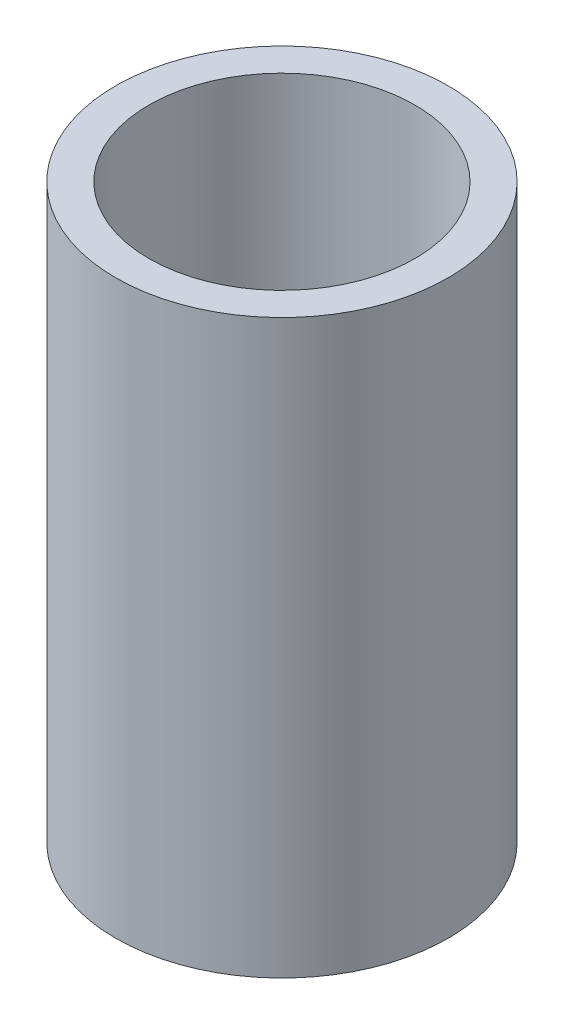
ISO-10303-21;
HEADER;
FILE_DESCRIPTION(('STEP AP214'),'2;1');
FILE_NAME('part.step','',(''),(''),'','','');
FILE_SCHEMA(('AUTOMOTIVE_DESIGN { 1 0 10303 214 1 1 1 1 }'));
ENDSEC;
DATA;
#1=APPLICATION_CONTEXT('core data for automotive mechanical design processes');
#2=APPLICATION_PROTOCOL_DEFINITION('international standard','automotive_design',2000,#1);
#3=PRODUCT_CONTEXT('',#1,'mechanical');
#4=PRODUCT('Part','Part','',(#3));
#5=PRODUCT_RELATED_PRODUCT_CATEGORY('part','',(#4));
#6=PRODUCT_DEFINITION_FORMATION('','',#4);
#7=PRODUCT_DEFINITION_CONTEXT('part definition',#1,'design');
#8=PRODUCT_DEFINITION('design','',#6,#7);
#9=PRODUCT_DEFINITION_SHAPE('','',#8);
#10=(LENGTH_UNIT() NAMED_UNIT(*) SI_UNIT(.MILLI.,.METRE.));
#11=(NAMED_UNIT(*) PLANE_ANGLE_UNIT() SI_UNIT($,.RADIAN.));
#12=(NAMED_UNIT(*) SI_UNIT($,.STERADIAN.) SOLID_ANGLE_UNIT());
#13=UNCERTAINTY_MEASURE_WITH_UNIT(LENGTH_MEASURE(1.E-05),#10,'distance_accuracy_value','');
#14=(GEOMETRIC_REPRESENTATION_CONTEXT(3) GLOBAL_UNCERTAINTY_ASSIGNED_CONTEXT((#13)) GLOBAL_UNIT_ASSIGNED_CONTEXT((#10,
#11,#12)) REPRESENTATION_CONTEXT('',''));
#15=CARTESIAN_POINT('',(0.,0.,0.));
#16=DIRECTION('',(0.,0.,1.));
#17=DIRECTION('',(1.,0.,0.));
#18=AXIS2_PLACEMENT_3D('',#15,#16,#17);
#19=CARTESIAN_POINT('',(0.,-43.,0.));
#20=DIRECTION('',(0.,1.,0.));
#21=DIRECTION('',(0.,0.,1.));
#22=AXIS2_PLACEMENT_3D('',#19,#20,#21);
#23=CYLINDRICAL_SURFACE('',#22,12.5);
#24=CARTESIAN_POINT('',(0.,-43.,0.));
#25=DIRECTION('',(0.,1.,0.));
#26=DIRECTION('',(0.,0.,1.));
#27=AXIS2_PLACEMENT_3D('',#24,#25,#26);
#28=CIRCLE('',#27,12.5);
#29=CARTESIAN_POINT('',(0.,-43.,12.5));
#30=VERTEX_POINT('',#29);
#31=EDGE_CURVE('E10',#30,#30,#28,.T.);
#32=ORIENTED_EDGE('',*,*,#31,.T.);
#33=EDGE_LOOP('',(#32));
#34=FACE_BOUND('',#33,.T.);
#35=CARTESIAN_POINT('',(0.,0.,0.));
#36=DIRECTION('',(0.,1.,0.));
#37=DIRECTION('',(0.,0.,1.));
#38=AXIS2_PLACEMENT_3D('',#35,#36,#37);
#39=CIRCLE('',#38,12.5);
#40=CARTESIAN_POINT('',(0.,0.,12.5));
#41=VERTEX_POINT('',#40);
#42=EDGE_CURVE('E33',#41,#41,#39,.T.);
#43=ORIENTED_EDGE('',*,*,#42,.F.);
#44=EDGE_LOOP('',(#43));
#45=FACE_BOUND('',#44,.T.);
#46=ADVANCED_FACE('F30',(#34,#45),#23,.T.);
#47=CARTESIAN_POINT('',(0.,-43.,0.));
#48=DIRECTION('',(0.,1.,0.));
#49=DIRECTION('',(0.,0.,1.));
#50=AXIS2_PLACEMENT_3D('',#47,#48,#49);
#51=PLANE('',#50);
#52=CARTESIAN_POINT('',(0.,-43.,0.));
#53=DIRECTION('',(0.,1.,0.));
#54=DIRECTION('',(0.,0.,1.));
#55=AXIS2_PLACEMENT_3D('',#52,#53,#54);
#56=CIRCLE('',#55,10.);
#57=CARTESIAN_POINT('',(0.,-43.,10.));
#58=VERTEX_POINT('',#57);
#59=EDGE_CURVE('E40',#58,#58,#56,.T.);
#60=ORIENTED_EDGE('',*,*,#59,.T.);
#61=EDGE_LOOP('',(#60));
#62=FACE_BOUND('',#61,.T.);
#63=ORIENTED_EDGE('',*,*,#31,.F.);
#64=EDGE_LOOP('',(#63));
#65=FACE_BOUND('',#64,.T.);
#66=ADVANCED_FACE('F48',(#62,#65),#51,.F.);
#67=CARTESIAN_POINT('',(0.,0.,0.));
#68=DIRECTION('',(0.,1.,0.));
#69=DIRECTION('',(0.,0.,1.));
#70=AXIS2_PLACEMENT_3D('',#67,#68,#69);
#71=PLANE('',#70);
#72=CARTESIAN_POINT('',(0.,0.,0.));
#73=DIRECTION('',(0.,1.,0.));
#74=DIRECTION('',(0.,0.,1.));
#75=AXIS2_PLACEMENT_3D('',#72,#73,#74);
#76=CIRCLE('',#75,10.);
#77=CARTESIAN_POINT('',(0.,0.,10.));
#78=VERTEX_POINT('',#77);
#79=EDGE_CURVE('E42',#78,#78,#76,.T.);
#80=ORIENTED_EDGE('',*,*,#79,.F.);
#81=EDGE_LOOP('',(#80));
#82=FACE_BOUND('',#81,.T.);
#83=ORIENTED_EDGE('',*,*,#42,.T.);
#84=EDGE_LOOP('',(#83));
#85=FACE_BOUND('',#84,.T.);
#86=ADVANCED_FACE('F54',(#82,#85),#71,.T.);
#87=CARTESIAN_POINT('',(0.,-43.,0.));
#88=DIRECTION('',(0.,1.,0.));
#89=DIRECTION('',(0.,0.,1.));
#90=AXIS2_PLACEMENT_3D('',#87,#88,#89);
#91=CYLINDRICAL_SURFACE('',#90,10.);
#92=ORIENTED_EDGE('',*,*,#59,.F.);
#93=EDGE_LOOP('',(#92));
#94=FACE_BOUND('',#93,.T.);
#95=ORIENTED_EDGE('',*,*,#79,.T.);
#96=EDGE_LOOP('',(#95));
#97=FACE_BOUND('',#96,.T.);
#98=ADVANCED_FACE('F51',(#94,#97),#91,.F.);
#99=CLOSED_SHELL('',(#46,#66,#86,#98));
#100=MANIFOLD_SOLID_BREP('B2',#99);
#101=ADVANCED_BREP_SHAPE_REPRESENTATION('',(#18,#100),#14);
#102=SHAPE_DEFINITION_REPRESENTATION(#9,#101);
ENDSEC;
END-ISO-10303-21;
